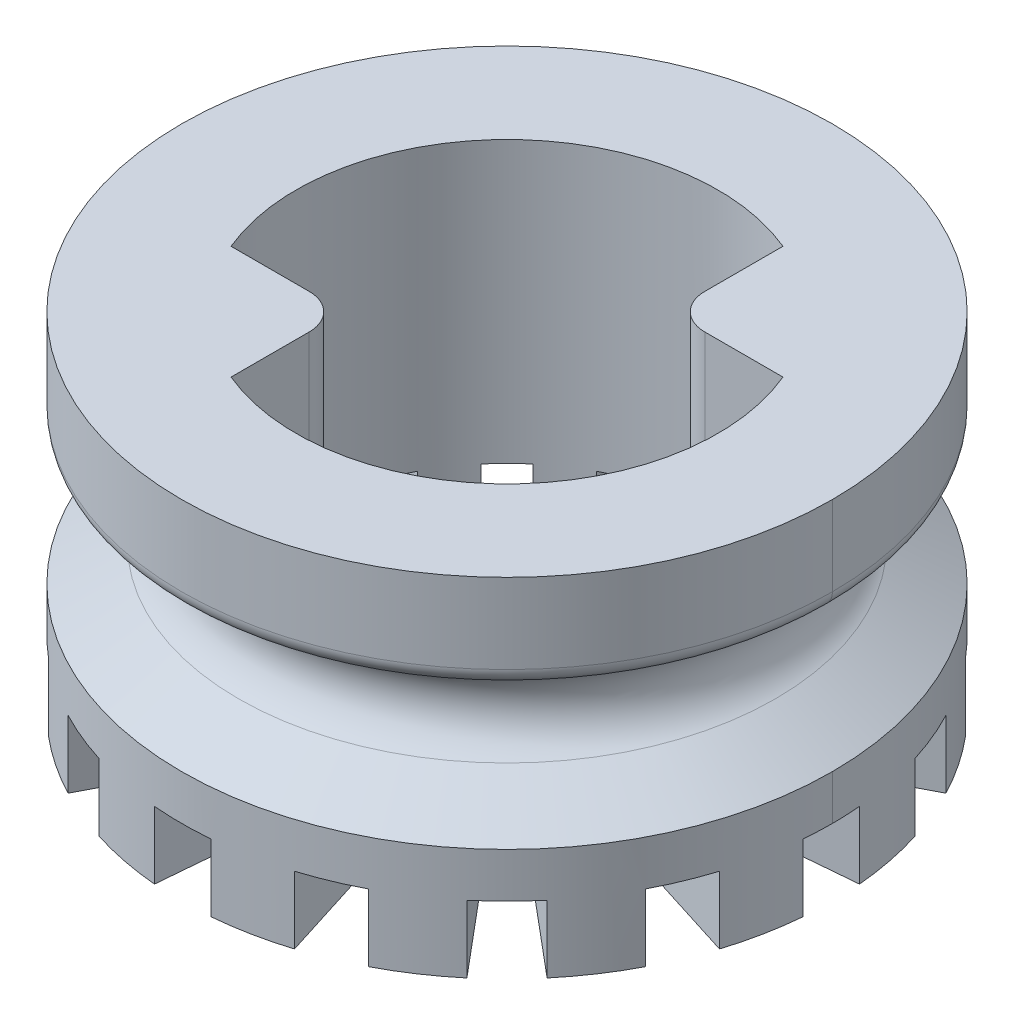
from build123d import *

# Parameters (mm, degrees)
SKETCH1_R           = 3.683
BASE_EXTRUDE_DEPTH  = 3.937
SKETCH2_R           = 2.3876
CUT_EXTRUDE1_DEPTH  = 7.529084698
CUT_EXTRUDE2_DEPTH  = 0.762
CIRPATTERN1_COUNT   = 16
BOSS_EXTRUDE1_DEPTH = 3.175
FILLET1_R           = 0.396875
FILLET2_R           = 0.1984375


with BuildPart() as part:
    # Sketch1 → Base-Extrude (new body)
    with BuildSketch(Plane(origin=(0, 0, 0), x_dir=(1, 0, 0), z_dir=(0, 1, 0))):
        with Locations(Location((0, 0, 0), (0, 0, 270))):
            Circle(SKETCH1_R)
    extrude(amount=BASE_EXTRUDE_DEPTH)

    # Sketch2 → Cut-Extrude1 (cut, through all)
    with BuildSketch(Plane(origin=(0, 3.937, 0), x_dir=(-1, 0, 0), z_dir=(0, 1, 0))):
        with Locations(Location((0, 0, 0), (0, 0, 90))):
            Circle(SKETCH2_R)
    extrude(amount=-CUT_EXTRUDE1_DEPTH, mode=Mode.SUBTRACT)

    # Sketch4 → Cut-Revolve1 (revolve, cut)
    with BuildSketch(Plane.XY, mode=Mode.PRIVATE) as cut_revolve1_sk:
        with BuildLine():
            Line((3.683, 2.921), (3.038418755, 2.529768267))
            ThreePointArc((3.038418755, 2.529768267), (2.794, 2.0955), (3.038418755, 1.661231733))
            Line((3.038418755, 1.661231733), (3.683, 1.27))
            Line((3.683, 1.27), (3.683, 2.921))
        make_face()
    revolve(cut_revolve1_sk.sketch.rotate(Axis((0, 0, 0), (0, 1, 0)), 90), axis=Axis((0, 0, 0), (0, 1, 0)), mode=Mode.SUBTRACT)

    # Sketch5 → Cut-Extrude2 (cut)
    with BuildSketch(Plane(origin=(16.494267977, 0, 2.582932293), x_dir=(1, 0, 0), z_dir=(0, -1, 0))):
        with BuildLine():
            Line((-18.872782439, -2.374839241), (-20.163253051, -2.261937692))
            ThreePointArc((-20.163253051, -2.261937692), (-20.177267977, -2.582932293), (-20.163253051, -2.903926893))
            Line((-20.163253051, -2.903926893), (-18.872782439, -2.791025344))
            ThreePointArc((-18.872782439, -2.791025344), (-18.881867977, -2.582932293), (-18.872782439, -2.374839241))
        make_face()
    cut_extrude2 = extrude(amount=-CUT_EXTRUDE2_DEPTH, mode=Mode.SUBTRACT)

    # CirPattern1: Cut-Extrude2 ×16 about axis
    cirpattern1_axis = Axis((0, 0, 0), (0, 1, 0))
    for i in range(1, CIRPATTERN1_COUNT):
        add(cut_extrude2.rotate(cirpattern1_axis, i * 360 / CIRPATTERN1_COUNT), mode=Mode.SUBTRACT)

    # Sketch6 → Boss-Extrude1 (add)
    with BuildSketch(Plane(origin=(0, 3.937, 0), x_dir=(-1, 0, 0), z_dir=(0, 1, 0))):
        with BuildLine():
            Line((-0.92075, -2.202919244), (-0.92075, -0.92075))
            Line((-0.92075, -0.92075), (-2.202919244, -0.92075))
            ThreePointArc((-2.202919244, -0.92075), (-1.688288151, -1.688288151), (-0.92075, -2.202919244))
        make_face()
        with BuildLine():
            Line((2.202919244, 0.92075), (0.92075, 0.92075))
            Line((0.92075, 0.92075), (0.92075, 2.202919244))
            ThreePointArc((0.92075, 2.202919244), (1.688288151, 1.688288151), (2.202919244, 0.92075))
        make_face()
    extrude(amount=-BOSS_EXTRUDE1_DEPTH)

    # Fillet1
    fillet1_edges = [part.edges().sort_by_distance(p)[0] for p in [
        (0.92075, 2.3495, -0.92075),
        (-0.92075, 2.3495, 0.92075),
    ]]
    fillet(fillet1_edges, radius=FILLET1_R)

    # Fillet2
    fillet2_edges = [part.edges().sort_by_distance(p)[0] for p in [
        (-3.683, 2.921, 0),
        (-3.683, 2.921, 0),
    ]]
    fillet(fillet2_edges, radius=FILLET2_R)


solid = part.part
